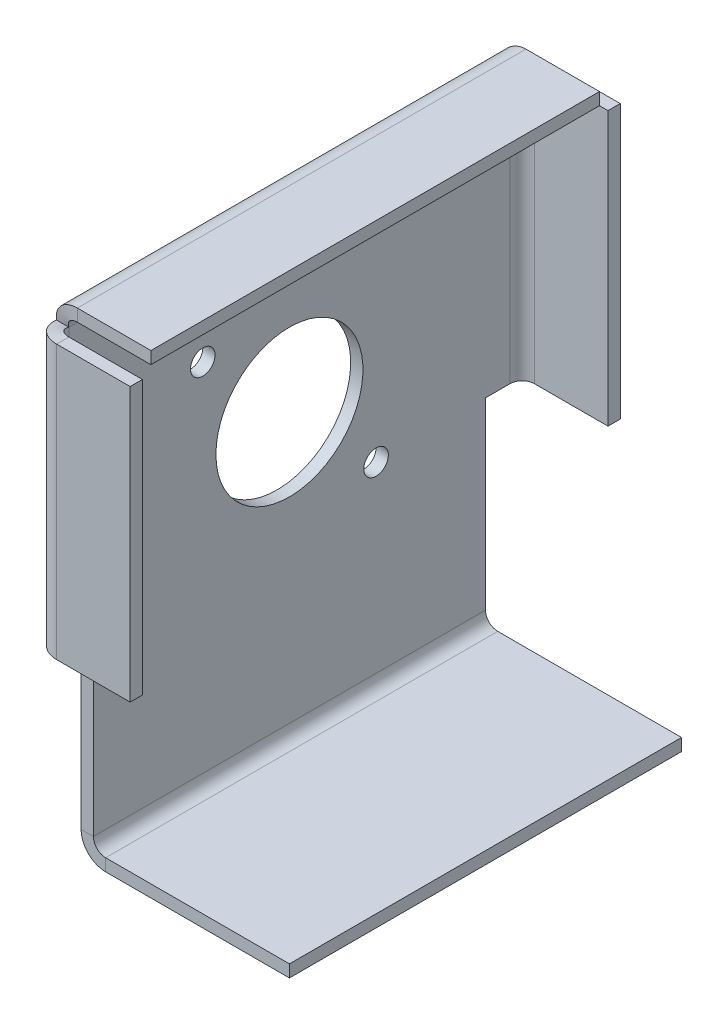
ISO-10303-21;
HEADER;
FILE_DESCRIPTION(('STEP AP214'),'2;1');
FILE_NAME('part.step','',(''),(''),'','','');
FILE_SCHEMA(('AUTOMOTIVE_DESIGN { 1 0 10303 214 1 1 1 1 }'));
ENDSEC;
DATA;
#1=APPLICATION_CONTEXT('core data for automotive mechanical design processes');
#2=APPLICATION_PROTOCOL_DEFINITION('international standard','automotive_design',2000,#1);
#3=PRODUCT_CONTEXT('',#1,'mechanical');
#4=PRODUCT('Part','Part','',(#3));
#5=PRODUCT_RELATED_PRODUCT_CATEGORY('part','',(#4));
#6=PRODUCT_DEFINITION_FORMATION('','',#4);
#7=PRODUCT_DEFINITION_CONTEXT('part definition',#1,'design');
#8=PRODUCT_DEFINITION('design','',#6,#7);
#9=PRODUCT_DEFINITION_SHAPE('','',#8);
#10=(LENGTH_UNIT() NAMED_UNIT(*) SI_UNIT(.MILLI.,.METRE.));
#11=(NAMED_UNIT(*) PLANE_ANGLE_UNIT() SI_UNIT($,.RADIAN.));
#12=(NAMED_UNIT(*) SI_UNIT($,.STERADIAN.) SOLID_ANGLE_UNIT());
#13=UNCERTAINTY_MEASURE_WITH_UNIT(LENGTH_MEASURE(1.E-05),#10,'distance_accuracy_value','');
#14=(GEOMETRIC_REPRESENTATION_CONTEXT(3) GLOBAL_UNCERTAINTY_ASSIGNED_CONTEXT((#13)) GLOBAL_UNIT_ASSIGNED_CONTEXT((#10,
#11,#12)) REPRESENTATION_CONTEXT('',''));
#15=CARTESIAN_POINT('',(0.,0.,0.));
#16=DIRECTION('',(0.,0.,1.));
#17=DIRECTION('',(1.,0.,0.));
#18=AXIS2_PLACEMENT_3D('',#15,#16,#17);
#19=CARTESIAN_POINT('',(0.,0.,25.4));
#20=DIRECTION('',(1.,0.,0.));
#21=DIRECTION('',(0.,0.,-1.));
#22=AXIS2_PLACEMENT_3D('',#19,#20,#21);
#23=PLANE('',#22);
#24=CARTESIAN_POINT('',(0.,25.2871798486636,-11.2253201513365));
#25=DIRECTION('',(-1.,0.,0.));
#26=DIRECTION('',(0.,0.,1.));
#27=AXIS2_PLACEMENT_3D('',#24,#25,#26);
#28=CIRCLE('',#27,1.5875);
#29=CARTESIAN_POINT('',(0.,25.2871798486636,-9.6378201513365));
#30=VERTEX_POINT('',#29);
#31=EDGE_CURVE('E851',#30,#30,#28,.T.);
#32=ORIENTED_EDGE('',*,*,#31,.T.);
#33=EDGE_LOOP('',(#32));
#34=FACE_BOUND('',#33,.T.);
#35=CARTESIAN_POINT('',(0.,47.7378201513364,11.2253201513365));
#36=DIRECTION('',(-1.,0.,0.));
#37=DIRECTION('',(0.,0.,1.));
#38=AXIS2_PLACEMENT_3D('',#35,#36,#37);
#39=CIRCLE('',#38,1.5875);
#40=CARTESIAN_POINT('',(0.,47.7378201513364,12.8128201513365));
#41=VERTEX_POINT('',#40);
#42=EDGE_CURVE('E861',#41,#41,#39,.T.);
#43=ORIENTED_EDGE('',*,*,#42,.T.);
#44=EDGE_LOOP('',(#43));
#45=FACE_BOUND('',#44,.T.);
#46=CARTESIAN_POINT('',(0.,36.5125,0.));
#47=DIRECTION('',(-1.,0.,0.));
#48=DIRECTION('',(0.,0.,1.));
#49=AXIS2_PLACEMENT_3D('',#46,#47,#48);
#50=CIRCLE('',#49,9.525);
#51=CARTESIAN_POINT('',(0.,36.5125,9.525));
#52=VERTEX_POINT('',#51);
#53=EDGE_CURVE('E227',#52,#52,#50,.T.);
#54=ORIENTED_EDGE('',*,*,#53,.T.);
#55=EDGE_LOOP('',(#54));
#56=FACE_BOUND('',#55,.T.);
#57=DIRECTION('',(0.,0.,-1.));
#58=VECTOR('',#57,1.);
#59=CARTESIAN_POINT('',(0.,25.4,-25.4));
#60=LINE('',#59,#58);
#61=CARTESIAN_POINT('',(0.,25.4,-25.4));
#62=VERTEX_POINT('',#61);
#63=CARTESIAN_POINT('',(0.,25.4,-28.5749999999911));
#64=VERTEX_POINT('',#63);
#65=EDGE_CURVE('E356',#62,#64,#60,.T.);
#66=ORIENTED_EDGE('',*,*,#65,.T.);
#67=DIRECTION('',(0.,-1.,0.));
#68=VECTOR('',#67,1.);
#69=CARTESIAN_POINT('',(0.,63.500000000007,-28.5749999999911));
#70=LINE('',#69,#68);
#71=CARTESIAN_POINT('',(0.,60.3249999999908,-28.5749999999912));
#72=VERTEX_POINT('',#71);
#73=EDGE_CURVE('E241',#72,#64,#70,.T.);
#74=ORIENTED_EDGE('',*,*,#73,.F.);
#75=DIRECTION('',(0.,0.,-1.));
#76=VECTOR('',#75,1.);
#77=CARTESIAN_POINT('',(0.,60.3249999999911,31.750000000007));
#78=LINE('',#77,#76);
#79=CARTESIAN_POINT('',(0.,60.3249999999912,28.5749999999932));
#80=VERTEX_POINT('',#79);
#81=EDGE_CURVE('E255',#80,#72,#78,.T.);
#82=ORIENTED_EDGE('',*,*,#81,.F.);
#83=DIRECTION('',(0.,1.,0.));
#84=VECTOR('',#83,1.);
#85=CARTESIAN_POINT('',(0.,-292.100000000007,28.5749999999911));
#86=LINE('',#85,#84);
#87=CARTESIAN_POINT('',(0.,25.4,28.5749999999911));
#88=VERTEX_POINT('',#87);
#89=EDGE_CURVE('E311',#88,#80,#86,.T.);
#90=ORIENTED_EDGE('',*,*,#89,.F.);
#91=DIRECTION('',(0.,0.,-1.));
#92=VECTOR('',#91,1.);
#93=CARTESIAN_POINT('',(0.,25.4,25.4));
#94=LINE('',#93,#92);
#95=CARTESIAN_POINT('',(0.,25.4,25.4));
#96=VERTEX_POINT('',#95);
#97=EDGE_CURVE('E364',#88,#96,#94,.T.);
#98=ORIENTED_EDGE('',*,*,#97,.T.);
#99=DIRECTION('',(0.,-1.,0.));
#100=VECTOR('',#99,1.);
#101=CARTESIAN_POINT('',(0.,0.,25.4));
#102=LINE('',#101,#100);
#103=CARTESIAN_POINT('',(0.,1.5875,25.4));
#104=VERTEX_POINT('',#103);
#105=EDGE_CURVE('E401',#96,#104,#102,.T.);
#106=ORIENTED_EDGE('',*,*,#105,.T.);
#107=DIRECTION('',(0.,0.,-1.));
#108=VECTOR('',#107,1.);
#109=CARTESIAN_POINT('',(0.,1.5875,25.4));
#110=LINE('',#109,#108);
#111=CARTESIAN_POINT('',(0.,1.5875,-25.4));
#112=VERTEX_POINT('',#111);
#113=EDGE_CURVE('E414',#104,#112,#110,.T.);
#114=ORIENTED_EDGE('',*,*,#113,.T.);
#115=DIRECTION('',(0.,-1.,0.));
#116=VECTOR('',#115,1.);
#117=CARTESIAN_POINT('',(0.,0.,-25.4));
#118=LINE('',#117,#116);
#119=EDGE_CURVE('E383',#62,#112,#118,.T.);
#120=ORIENTED_EDGE('',*,*,#119,.F.);
#121=EDGE_LOOP('',(#66,#74,#82,#90,#98,#106,#114,#120));
#122=FACE_BOUND('',#121,.T.);
#123=ADVANCED_FACE('F30',(#34,#45,#56,#122),#23,.T.);
#124=CARTESIAN_POINT('',(-1.5875,0.,25.4));
#125=DIRECTION('',(1.,0.,0.));
#126=DIRECTION('',(0.,0.,-1.));
#127=AXIS2_PLACEMENT_3D('',#124,#125,#126);
#128=PLANE('',#127);
#129=CARTESIAN_POINT('',(-1.5875,25.2871798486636,-11.2253201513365));
#130=DIRECTION('',(-1.,0.,0.));
#131=DIRECTION('',(0.,0.,1.));
#132=AXIS2_PLACEMENT_3D('',#129,#130,#131);
#133=CIRCLE('',#132,1.5875);
#134=CARTESIAN_POINT('',(-1.5875,25.2871798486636,-9.6378201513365));
#135=VERTEX_POINT('',#134);
#136=EDGE_CURVE('E854',#135,#135,#133,.T.);
#137=ORIENTED_EDGE('',*,*,#136,.F.);
#138=EDGE_LOOP('',(#137));
#139=FACE_BOUND('',#138,.T.);
#140=CARTESIAN_POINT('',(-1.5875,47.7378201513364,11.2253201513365));
#141=DIRECTION('',(-1.,0.,0.));
#142=DIRECTION('',(0.,0.,1.));
#143=AXIS2_PLACEMENT_3D('',#140,#141,#142);
#144=CIRCLE('',#143,1.5875);
#145=CARTESIAN_POINT('',(-1.5875,47.7378201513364,12.8128201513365));
#146=VERTEX_POINT('',#145);
#147=EDGE_CURVE('E856',#146,#146,#144,.T.);
#148=ORIENTED_EDGE('',*,*,#147,.F.);
#149=EDGE_LOOP('',(#148));
#150=FACE_BOUND('',#149,.T.);
#151=CARTESIAN_POINT('',(-1.5875,36.5125,0.));
#152=DIRECTION('',(-1.,0.,0.));
#153=DIRECTION('',(0.,0.,1.));
#154=AXIS2_PLACEMENT_3D('',#151,#152,#153);
#155=CIRCLE('',#154,9.525);
#156=CARTESIAN_POINT('',(-1.5875,36.5125,9.525));
#157=VERTEX_POINT('',#156);
#158=EDGE_CURVE('E864',#157,#157,#155,.T.);
#159=ORIENTED_EDGE('',*,*,#158,.F.);
#160=EDGE_LOOP('',(#159));
#161=FACE_BOUND('',#160,.T.);
#162=DIRECTION('',(0.,-1.,0.));
#163=VECTOR('',#162,1.);
#164=CARTESIAN_POINT('',(-1.5875,63.5000000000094,-28.5749999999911));
#165=LINE('',#164,#163);
#166=CARTESIAN_POINT('',(-1.5875,60.3249999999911,-28.5749999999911));
#167=VERTEX_POINT('',#166);
#168=CARTESIAN_POINT('',(-1.5875,25.4,-28.5749999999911));
#169=VERTEX_POINT('',#168);
#170=EDGE_CURVE('E237',#167,#169,#165,.T.);
#171=ORIENTED_EDGE('',*,*,#170,.T.);
#172=DIRECTION('',(0.,0.,-1.));
#173=VECTOR('',#172,1.);
#174=CARTESIAN_POINT('',(-1.5875,25.4,-25.4));
#175=LINE('',#174,#173);
#176=CARTESIAN_POINT('',(-1.5875,25.4,-25.4));
#177=VERTEX_POINT('',#176);
#178=EDGE_CURVE('E52',#177,#169,#175,.T.);
#179=ORIENTED_EDGE('',*,*,#178,.F.);
#180=DIRECTION('',(0.,1.,0.));
#181=VECTOR('',#180,1.);
#182=CARTESIAN_POINT('',(-1.5875,0.,-25.4));
#183=LINE('',#182,#181);
#184=CARTESIAN_POINT('',(-1.5875,1.5875,-25.4));
#185=VERTEX_POINT('',#184);
#186=EDGE_CURVE('E385',#177,#185,#183,.F.);
#187=ORIENTED_EDGE('',*,*,#186,.T.);
#188=DIRECTION('',(0.,0.,-1.));
#189=VECTOR('',#188,1.);
#190=CARTESIAN_POINT('',(-1.5875,1.5875,25.4));
#191=LINE('',#190,#189);
#192=CARTESIAN_POINT('',(-1.5875,1.5875,25.4));
#193=VERTEX_POINT('',#192);
#194=EDGE_CURVE('E411',#193,#185,#191,.T.);
#195=ORIENTED_EDGE('',*,*,#194,.F.);
#196=DIRECTION('',(0.,1.,0.));
#197=VECTOR('',#196,1.);
#198=CARTESIAN_POINT('',(-1.5875,0.,25.4));
#199=LINE('',#198,#197);
#200=CARTESIAN_POINT('',(-1.5875,25.4,25.4));
#201=VERTEX_POINT('',#200);
#202=EDGE_CURVE('E403',#201,#193,#199,.F.);
#203=ORIENTED_EDGE('',*,*,#202,.F.);
#204=DIRECTION('',(0.,0.,-1.));
#205=VECTOR('',#204,1.);
#206=CARTESIAN_POINT('',(-1.5875,25.4,25.4));
#207=LINE('',#206,#205);
#208=CARTESIAN_POINT('',(-1.5875,25.3999999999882,28.5749999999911));
#209=VERTEX_POINT('',#208);
#210=EDGE_CURVE('E366',#209,#201,#207,.T.);
#211=ORIENTED_EDGE('',*,*,#210,.F.);
#212=DIRECTION('',(0.,1.,0.));
#213=VECTOR('',#212,1.);
#214=CARTESIAN_POINT('',(-1.5875,-292.100000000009,28.5749999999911));
#215=LINE('',#214,#213);
#216=CARTESIAN_POINT('',(-1.5875,60.3249999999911,28.5749999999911));
#217=VERTEX_POINT('',#216);
#218=EDGE_CURVE('E283',#209,#217,#215,.T.);
#219=ORIENTED_EDGE('',*,*,#218,.T.);
#220=DIRECTION('',(0.,0.,-1.));
#221=VECTOR('',#220,1.);
#222=CARTESIAN_POINT('',(-1.5875,60.3249999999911,31.7500000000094));
#223=LINE('',#222,#221);
#224=EDGE_CURVE('E291',#217,#167,#223,.T.);
#225=ORIENTED_EDGE('',*,*,#224,.T.);
#226=EDGE_LOOP('',(#171,#179,#187,#195,#203,#211,#219,#225));
#227=FACE_BOUND('',#226,.T.);
#228=ADVANCED_FACE('F482',(#139,#150,#161,#227),#128,.F.);
#229=CARTESIAN_POINT('',(-1.5875,25.4,25.4));
#230=DIRECTION('',(0.,-1.,0.));
#231=DIRECTION('',(0.,0.,-1.));
#232=AXIS2_PLACEMENT_3D('',#229,#230,#231);
#233=PLANE('',#232);
#234=ORIENTED_EDGE('',*,*,#97,.F.);
#235=DIRECTION('',(1.,0.,0.));
#236=VECTOR('',#235,1.);
#237=CARTESIAN_POINT('',(-1.5875,25.3999999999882,28.5749999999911));
#238=LINE('',#237,#236);
#239=EDGE_CURVE('E321',#209,#88,#238,.T.);
#240=ORIENTED_EDGE('',*,*,#239,.F.);
#241=ORIENTED_EDGE('',*,*,#210,.T.);
#242=DIRECTION('',(1.,0.,0.));
#243=VECTOR('',#242,1.);
#244=CARTESIAN_POINT('',(-1.5875,25.4,25.4));
#245=LINE('',#244,#243);
#246=EDGE_CURVE('E368',#201,#96,#245,.T.);
#247=ORIENTED_EDGE('',*,*,#246,.T.);
#248=EDGE_LOOP('',(#234,#240,#241,#247));
#249=FACE_BOUND('',#248,.T.);
#250=ADVANCED_FACE('F489',(#249),#233,.T.);
#251=CARTESIAN_POINT('',(-1.5875,25.4,-25.4));
#252=DIRECTION('',(0.,-1.,0.));
#253=DIRECTION('',(0.,0.,-1.));
#254=AXIS2_PLACEMENT_3D('',#251,#252,#253);
#255=PLANE('',#254);
#256=ORIENTED_EDGE('',*,*,#178,.T.);
#257=DIRECTION('',(1.,0.,0.));
#258=VECTOR('',#257,1.);
#259=CARTESIAN_POINT('',(-1.5875,25.4,-28.5749999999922));
#260=LINE('',#259,#258);
#261=EDGE_CURVE('E45',#169,#64,#260,.T.);
#262=ORIENTED_EDGE('',*,*,#261,.T.);
#263=ORIENTED_EDGE('',*,*,#65,.F.);
#264=DIRECTION('',(1.,0.,0.));
#265=VECTOR('',#264,1.);
#266=CARTESIAN_POINT('',(-1.5875,25.4,-25.4));
#267=LINE('',#266,#265);
#268=EDGE_CURVE('E361',#177,#62,#267,.T.);
#269=ORIENTED_EDGE('',*,*,#268,.F.);
#270=EDGE_LOOP('',(#256,#262,#263,#269));
#271=FACE_BOUND('',#270,.T.);
#272=ADVANCED_FACE('F543',(#271),#255,.T.);
#273=CARTESIAN_POINT('',(1.5875,0.,25.4));
#274=DIRECTION('',(0.,0.,1.));
#275=DIRECTION('',(1.,0.,0.));
#276=AXIS2_PLACEMENT_3D('',#273,#274,#275);
#277=PLANE('',#276);
#278=DIRECTION('',(0.,-1.,0.));
#279=VECTOR('',#278,1.);
#280=CARTESIAN_POINT('',(1.5875,0.,25.4));
#281=LINE('',#280,#279);
#282=CARTESIAN_POINT('',(1.5875,0.,25.4));
#283=VERTEX_POINT('',#282);
#284=CARTESIAN_POINT('',(1.5875,-1.5875,25.4));
#285=VERTEX_POINT('',#284);
#286=EDGE_CURVE('E11',#283,#285,#281,.T.);
#287=ORIENTED_EDGE('',*,*,#286,.F.);
#288=CARTESIAN_POINT('',(1.5875,1.5875,25.4));
#289=DIRECTION('',(0.,0.,-1.));
#290=DIRECTION('',(-1.,0.,0.));
#291=AXIS2_PLACEMENT_3D('',#288,#289,#290);
#292=CIRCLE('',#291,1.5875);
#293=EDGE_CURVE('E398',#104,#283,#292,.F.);
#294=ORIENTED_EDGE('',*,*,#293,.F.);
#295=DIRECTION('',(1.,0.,0.));
#296=VECTOR('',#295,1.);
#297=CARTESIAN_POINT('',(-1.5875,1.5875,25.4));
#298=LINE('',#297,#296);
#299=EDGE_CURVE('E38',#193,#104,#298,.T.);
#300=ORIENTED_EDGE('',*,*,#299,.F.);
#301=CARTESIAN_POINT('',(1.5875,1.5875,25.4));
#302=DIRECTION('',(0.,0.,1.));
#303=DIRECTION('',(1.,0.,0.));
#304=AXIS2_PLACEMENT_3D('',#301,#302,#303);
#305=CIRCLE('',#304,3.175);
#306=EDGE_CURVE('E405',#193,#285,#305,.T.);
#307=ORIENTED_EDGE('',*,*,#306,.T.);
#308=EDGE_LOOP('',(#287,#294,#300,#307));
#309=FACE_BOUND('',#308,.T.);
#310=ADVANCED_FACE('F32',(#309),#277,.T.);
#311=CARTESIAN_POINT('',(-1.5875,1.5875,25.4));
#312=DIRECTION('',(0.,0.,1.));
#313=DIRECTION('',(1.,0.,0.));
#314=AXIS2_PLACEMENT_3D('',#311,#312,#313);
#315=PLANE('',#314);
#316=DIRECTION('',(1.,0.,0.));
#317=VECTOR('',#316,1.);
#318=CARTESIAN_POINT('',(0.,0.,25.4));
#319=LINE('',#318,#317);
#320=CARTESIAN_POINT('',(25.4,0.,25.4));
#321=VERTEX_POINT('',#320);
#322=EDGE_CURVE('E395',#283,#321,#319,.T.);
#323=ORIENTED_EDGE('',*,*,#322,.F.);
#324=ORIENTED_EDGE('',*,*,#286,.T.);
#325=DIRECTION('',(1.,0.,0.));
#326=VECTOR('',#325,1.);
#327=CARTESIAN_POINT('',(0.,-1.5875,25.4));
#328=LINE('',#327,#326);
#329=CARTESIAN_POINT('',(25.4,-1.5875,25.4));
#330=VERTEX_POINT('',#329);
#331=EDGE_CURVE('E390',#285,#330,#328,.T.);
#332=ORIENTED_EDGE('',*,*,#331,.T.);
#333=DIRECTION('',(0.,-1.,0.));
#334=VECTOR('',#333,1.);
#335=CARTESIAN_POINT('',(25.4,0.,25.4));
#336=LINE('',#335,#334);
#337=EDGE_CURVE('E392',#321,#330,#336,.T.);
#338=ORIENTED_EDGE('',*,*,#337,.F.);
#339=EDGE_LOOP('',(#323,#324,#332,#338));
#340=FACE_BOUND('',#339,.T.);
#341=ADVANCED_FACE('F453',(#340),#315,.T.);
#342=CARTESIAN_POINT('',(0.,1.5875,-25.4));
#343=DIRECTION('',(0.,0.,-1.));
#344=DIRECTION('',(-1.,0.,0.));
#345=AXIS2_PLACEMENT_3D('',#342,#343,#344);
#346=PLANE('',#345);
#347=DIRECTION('',(-1.,0.,0.));
#348=VECTOR('',#347,1.);
#349=CARTESIAN_POINT('',(0.,1.5875,-25.4));
#350=LINE('',#349,#348);
#351=EDGE_CURVE('E426',#112,#185,#350,.T.);
#352=ORIENTED_EDGE('',*,*,#351,.F.);
#353=CARTESIAN_POINT('',(1.5875,1.5875,-25.4));
#354=DIRECTION('',(0.,0.,-1.));
#355=DIRECTION('',(-1.,0.,0.));
#356=AXIS2_PLACEMENT_3D('',#353,#354,#355);
#357=CIRCLE('',#356,1.5875);
#358=CARTESIAN_POINT('',(1.5875,0.,-25.4));
#359=VERTEX_POINT('',#358);
#360=EDGE_CURVE('E380',#112,#359,#357,.F.);
#361=ORIENTED_EDGE('',*,*,#360,.T.);
#362=DIRECTION('',(0.,1.,0.));
#363=VECTOR('',#362,1.);
#364=CARTESIAN_POINT('',(1.5875,-1.5875,-25.4));
#365=LINE('',#364,#363);
#366=CARTESIAN_POINT('',(1.5875,-1.5875,-25.4));
#367=VERTEX_POINT('',#366);
#368=EDGE_CURVE('E424',#367,#359,#365,.T.);
#369=ORIENTED_EDGE('',*,*,#368,.F.);
#370=CARTESIAN_POINT('',(1.5875,1.5875,-25.4));
#371=DIRECTION('',(0.,0.,1.));
#372=DIRECTION('',(1.,0.,0.));
#373=AXIS2_PLACEMENT_3D('',#370,#371,#372);
#374=CIRCLE('',#373,3.175);
#375=EDGE_CURVE('E387',#185,#367,#374,.T.);
#376=ORIENTED_EDGE('',*,*,#375,.F.);
#377=EDGE_LOOP('',(#352,#361,#369,#376));
#378=FACE_BOUND('',#377,.T.);
#379=ADVANCED_FACE('F465',(#378),#346,.T.);
#380=CARTESIAN_POINT('',(1.5875,-1.5875,-25.4));
#381=DIRECTION('',(0.,0.,-1.));
#382=DIRECTION('',(-1.,0.,0.));
#383=AXIS2_PLACEMENT_3D('',#380,#381,#382);
#384=PLANE('',#383);
#385=ORIENTED_EDGE('',*,*,#268,.T.);
#386=ORIENTED_EDGE('',*,*,#119,.T.);
#387=ORIENTED_EDGE('',*,*,#351,.T.);
#388=ORIENTED_EDGE('',*,*,#186,.F.);
#389=EDGE_LOOP('',(#385,#386,#387,#388));
#390=FACE_BOUND('',#389,.T.);
#391=ADVANCED_FACE('F471',(#390),#384,.T.);
#392=CARTESIAN_POINT('',(0.,-1.5875,25.4));
#393=DIRECTION('',(0.,1.,0.));
#394=DIRECTION('',(0.,0.,1.));
#395=AXIS2_PLACEMENT_3D('',#392,#393,#394);
#396=PLANE('',#395);
#397=DIRECTION('',(1.,0.,0.));
#398=VECTOR('',#397,1.);
#399=CARTESIAN_POINT('',(0.,-1.5875,-25.4));
#400=LINE('',#399,#398);
#401=CARTESIAN_POINT('',(25.4,-1.5875,-25.4));
#402=VERTEX_POINT('',#401);
#403=EDGE_CURVE('E371',#367,#402,#400,.T.);
#404=ORIENTED_EDGE('',*,*,#403,.T.);
#405=DIRECTION('',(0.,0.,-1.));
#406=VECTOR('',#405,1.);
#407=CARTESIAN_POINT('',(25.4,-1.5875,25.4));
#408=LINE('',#407,#406);
#409=EDGE_CURVE('E422',#330,#402,#408,.T.);
#410=ORIENTED_EDGE('',*,*,#409,.F.);
#411=ORIENTED_EDGE('',*,*,#331,.F.);
#412=DIRECTION('',(0.,0.,-1.));
#413=VECTOR('',#412,1.);
#414=CARTESIAN_POINT('',(1.5875,-1.5875,25.4));
#415=LINE('',#414,#413);
#416=EDGE_CURVE('E408',#285,#367,#415,.T.);
#417=ORIENTED_EDGE('',*,*,#416,.T.);
#418=EDGE_LOOP('',(#404,#410,#411,#417));
#419=FACE_BOUND('',#418,.T.);
#420=ADVANCED_FACE('F469',(#419),#396,.F.);
#421=CARTESIAN_POINT('',(25.4,0.,25.4));
#422=DIRECTION('',(1.,0.,0.));
#423=DIRECTION('',(0.,0.,-1.));
#424=AXIS2_PLACEMENT_3D('',#421,#422,#423);
#425=PLANE('',#424);
#426=DIRECTION('',(0.,-1.,0.));
#427=VECTOR('',#426,1.);
#428=CARTESIAN_POINT('',(25.4,0.,-25.4));
#429=LINE('',#428,#427);
#430=CARTESIAN_POINT('',(25.4,0.,-25.4));
#431=VERTEX_POINT('',#430);
#432=EDGE_CURVE('E374',#431,#402,#429,.T.);
#433=ORIENTED_EDGE('',*,*,#432,.F.);
#434=DIRECTION('',(0.,0.,-1.));
#435=VECTOR('',#434,1.);
#436=CARTESIAN_POINT('',(25.4,0.,25.4));
#437=LINE('',#436,#435);
#438=EDGE_CURVE('E420',#321,#431,#437,.T.);
#439=ORIENTED_EDGE('',*,*,#438,.F.);
#440=ORIENTED_EDGE('',*,*,#337,.T.);
#441=ORIENTED_EDGE('',*,*,#409,.T.);
#442=EDGE_LOOP('',(#433,#439,#440,#441));
#443=FACE_BOUND('',#442,.T.);
#444=ADVANCED_FACE('F458',(#443),#425,.T.);
#445=CARTESIAN_POINT('',(0.,0.,25.4));
#446=DIRECTION('',(0.,1.,0.));
#447=DIRECTION('',(0.,0.,1.));
#448=AXIS2_PLACEMENT_3D('',#445,#446,#447);
#449=PLANE('',#448);
#450=DIRECTION('',(1.,0.,0.));
#451=VECTOR('',#450,1.);
#452=CARTESIAN_POINT('',(0.,0.,-25.4));
#453=LINE('',#452,#451);
#454=EDGE_CURVE('E377',#359,#431,#453,.T.);
#455=ORIENTED_EDGE('',*,*,#454,.F.);
#456=DIRECTION('',(0.,0.,-1.));
#457=VECTOR('',#456,1.);
#458=CARTESIAN_POINT('',(1.5875,0.,25.4));
#459=LINE('',#458,#457);
#460=EDGE_CURVE('E417',#283,#359,#459,.T.);
#461=ORIENTED_EDGE('',*,*,#460,.F.);
#462=ORIENTED_EDGE('',*,*,#322,.T.);
#463=ORIENTED_EDGE('',*,*,#438,.T.);
#464=EDGE_LOOP('',(#455,#461,#462,#463));
#465=FACE_BOUND('',#464,.T.);
#466=ADVANCED_FACE('F451',(#465),#449,.T.);
#467=CARTESIAN_POINT('',(1.5875,1.5875,25.4));
#468=DIRECTION('',(0.,0.,-1.));
#469=DIRECTION('',(-1.,0.,0.));
#470=AXIS2_PLACEMENT_3D('',#467,#468,#469);
#471=CYLINDRICAL_SURFACE('',#470,1.5875);
#472=ORIENTED_EDGE('',*,*,#360,.F.);
#473=ORIENTED_EDGE('',*,*,#113,.F.);
#474=ORIENTED_EDGE('',*,*,#293,.T.);
#475=ORIENTED_EDGE('',*,*,#460,.T.);
#476=EDGE_LOOP('',(#472,#473,#474,#475));
#477=FACE_BOUND('',#476,.T.);
#478=ADVANCED_FACE('F441',(#477),#471,.F.);
#479=CARTESIAN_POINT('',(1.5875,1.5875,25.4));
#480=DIRECTION('',(0.,0.,-1.));
#481=DIRECTION('',(-1.,0.,0.));
#482=AXIS2_PLACEMENT_3D('',#479,#480,#481);
#483=CYLINDRICAL_SURFACE('',#482,3.175);
#484=ORIENTED_EDGE('',*,*,#375,.T.);
#485=ORIENTED_EDGE('',*,*,#416,.F.);
#486=ORIENTED_EDGE('',*,*,#306,.F.);
#487=ORIENTED_EDGE('',*,*,#194,.T.);
#488=EDGE_LOOP('',(#484,#485,#486,#487));
#489=FACE_BOUND('',#488,.T.);
#490=ADVANCED_FACE('F467',(#489),#483,.T.);
#491=CARTESIAN_POINT('',(1.5875,1.5875,25.4));
#492=DIRECTION('',(0.,0.,-1.));
#493=DIRECTION('',(-1.,0.,0.));
#494=AXIS2_PLACEMENT_3D('',#491,#492,#493);
#495=PLANE('',#494);
#496=ORIENTED_EDGE('',*,*,#105,.F.);
#497=ORIENTED_EDGE('',*,*,#246,.F.);
#498=ORIENTED_EDGE('',*,*,#202,.T.);
#499=ORIENTED_EDGE('',*,*,#299,.T.);
#500=EDGE_LOOP('',(#496,#497,#498,#499));
#501=FACE_BOUND('',#500,.T.);
#502=ADVANCED_FACE('F433',(#501),#495,.F.);
#503=CARTESIAN_POINT('',(1.5875,1.5875,-25.4));
#504=DIRECTION('',(0.,0.,-1.));
#505=DIRECTION('',(-1.,0.,0.));
#506=AXIS2_PLACEMENT_3D('',#503,#504,#505);
#507=PLANE('',#506);
#508=ORIENTED_EDGE('',*,*,#403,.F.);
#509=ORIENTED_EDGE('',*,*,#368,.T.);
#510=ORIENTED_EDGE('',*,*,#454,.T.);
#511=ORIENTED_EDGE('',*,*,#432,.T.);
#512=EDGE_LOOP('',(#508,#509,#510,#511));
#513=FACE_BOUND('',#512,.T.);
#514=ADVANCED_FACE('F461',(#513),#507,.T.);
#515=CARTESIAN_POINT('',(11.1125,25.4,31.75));
#516=DIRECTION('',(-1.,0.,-9.30467426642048E-13));
#517=DIRECTION('',(0.,1.,0.));
#518=AXIS2_PLACEMENT_3D('',#515,#516,#517);
#519=PLANE('',#518);
#520=DIRECTION('',(9.30467426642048E-13,0.,-1.));
#521=VECTOR('',#520,1.);
#522=CARTESIAN_POINT('',(11.1125,60.8059231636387,31.75));
#523=LINE('',#522,#521);
#524=CARTESIAN_POINT('',(11.1125,60.8059231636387,31.75));
#525=VERTEX_POINT('',#524);
#526=CARTESIAN_POINT('',(11.1125000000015,60.8059231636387,30.1625));
#527=VERTEX_POINT('',#526);
#528=EDGE_CURVE('E354',#525,#527,#523,.T.);
#529=ORIENTED_EDGE('',*,*,#528,.F.);
#530=DIRECTION('',(0.,1.,0.));
#531=VECTOR('',#530,1.);
#532=CARTESIAN_POINT('',(11.1125,25.4,31.75));
#533=LINE('',#532,#531);
#534=CARTESIAN_POINT('',(11.1125,25.4,31.75));
#535=VERTEX_POINT('',#534);
#536=EDGE_CURVE('E324',#535,#525,#533,.T.);
#537=ORIENTED_EDGE('',*,*,#536,.F.);
#538=DIRECTION('',(9.30467426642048E-13,0.,-1.));
#539=VECTOR('',#538,1.);
#540=CARTESIAN_POINT('',(11.1125,25.4,31.75));
#541=LINE('',#540,#539);
#542=CARTESIAN_POINT('',(11.1125000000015,25.4,30.1625));
#543=VERTEX_POINT('',#542);
#544=EDGE_CURVE('E352',#535,#543,#541,.T.);
#545=ORIENTED_EDGE('',*,*,#544,.T.);
#546=DIRECTION('',(0.,1.,0.));
#547=VECTOR('',#546,1.);
#548=CARTESIAN_POINT('',(11.1125000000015,25.4,30.1625));
#549=LINE('',#548,#547);
#550=EDGE_CURVE('E338',#543,#527,#549,.T.);
#551=ORIENTED_EDGE('',*,*,#550,.T.);
#552=EDGE_LOOP('',(#529,#537,#545,#551));
#553=FACE_BOUND('',#552,.T.);
#554=ADVANCED_FACE('F522',(#553),#519,.F.);
#555=CARTESIAN_POINT('',(11.1125,25.4,31.75));
#556=DIRECTION('',(7.44701763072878E-13,-1.,0.));
#557=DIRECTION('',(-1.,-7.44701763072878E-13,-9.30467426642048E-13));
#558=AXIS2_PLACEMENT_3D('',#555,#556,#557);
#559=PLANE('',#558);
#560=ORIENTED_EDGE('',*,*,#544,.F.);
#561=DIRECTION('',(-1.,-7.44701763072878E-13,-9.30467426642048E-13));
#562=VECTOR('',#561,1.);
#563=CARTESIAN_POINT('',(11.1125,25.4,31.75));
#564=LINE('',#563,#562);
#565=CARTESIAN_POINT('',(1.58749999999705,25.3999999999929,31.7499999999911));
#566=VERTEX_POINT('',#565);
#567=EDGE_CURVE('E327',#535,#566,#564,.T.);
#568=ORIENTED_EDGE('',*,*,#567,.T.);
#569=DIRECTION('',(9.30467426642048E-13,0.,-1.));
#570=VECTOR('',#569,1.);
#571=CARTESIAN_POINT('',(1.58749999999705,25.3999999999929,31.7499999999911));
#572=LINE('',#571,#570);
#573=CARTESIAN_POINT('',(1.58749999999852,25.3999999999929,30.1624999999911));
#574=VERTEX_POINT('',#573);
#575=EDGE_CURVE('E350',#566,#574,#572,.T.);
#576=ORIENTED_EDGE('',*,*,#575,.T.);
#577=DIRECTION('',(-1.,0.,-9.30467426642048E-13));
#578=VECTOR('',#577,1.);
#579=CARTESIAN_POINT('',(11.1125000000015,25.4,30.1625));
#580=LINE('',#579,#578);
#581=EDGE_CURVE('E342',#543,#574,#580,.T.);
#582=ORIENTED_EDGE('',*,*,#581,.F.);
#583=EDGE_LOOP('',(#560,#568,#576,#582));
#584=FACE_BOUND('',#583,.T.);
#585=ADVANCED_FACE('F558',(#584),#559,.T.);
#586=CARTESIAN_POINT('',(11.1124999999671,60.8059231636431,31.75));
#587=DIRECTION('',(-9.30467426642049E-13,1.,0.));
#588=DIRECTION('',(1.,9.30467426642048E-13,9.30467426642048E-13));
#589=AXIS2_PLACEMENT_3D('',#586,#587,#588);
#590=PLANE('',#589);
#591=DIRECTION('',(1.,9.30467426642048E-13,9.30467426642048E-13));
#592=VECTOR('',#591,1.);
#593=CARTESIAN_POINT('',(11.1124999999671,60.8059231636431,31.75));
#594=LINE('',#593,#592);
#595=CARTESIAN_POINT('',(1.58749999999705,60.8059231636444,31.7499999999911));
#596=VERTEX_POINT('',#595);
#597=EDGE_CURVE('E335',#596,#525,#594,.T.);
#598=ORIENTED_EDGE('',*,*,#597,.T.);
#599=ORIENTED_EDGE('',*,*,#528,.T.);
#600=DIRECTION('',(-1.,0.,-9.30467426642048E-13));
#601=VECTOR('',#600,1.);
#602=CARTESIAN_POINT('',(11.1125000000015,60.8059231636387,30.1625));
#603=LINE('',#602,#601);
#604=CARTESIAN_POINT('',(1.58749999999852,60.8059231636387,30.1624999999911));
#605=VERTEX_POINT('',#604);
#606=EDGE_CURVE('E341',#605,#527,#603,.F.);
#607=ORIENTED_EDGE('',*,*,#606,.F.);
#608=DIRECTION('',(9.30467426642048E-13,0.,-1.));
#609=VECTOR('',#608,1.);
#610=CARTESIAN_POINT('',(1.58749999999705,60.8059231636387,31.7499999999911));
#611=LINE('',#610,#609);
#612=EDGE_CURVE('E349',#596,#605,#611,.T.);
#613=ORIENTED_EDGE('',*,*,#612,.F.);
#614=EDGE_LOOP('',(#598,#599,#607,#613));
#615=FACE_BOUND('',#614,.T.);
#616=ADVANCED_FACE('F568',(#615),#590,.T.);
#617=CARTESIAN_POINT('',(11.1125000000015,25.4,30.1625));
#618=DIRECTION('',(9.30467426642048E-13,0.,-1.));
#619=DIRECTION('',(-1.,0.,-9.30467426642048E-13));
#620=AXIS2_PLACEMENT_3D('',#617,#618,#619);
#621=PLANE('',#620);
#622=DIRECTION('',(0.,1.,0.));
#623=VECTOR('',#622,1.);
#624=CARTESIAN_POINT('',(1.58749999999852,25.4,30.1624999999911));
#625=LINE('',#624,#623);
#626=EDGE_CURVE('E339',#574,#605,#625,.T.);
#627=ORIENTED_EDGE('',*,*,#626,.T.);
#628=ORIENTED_EDGE('',*,*,#606,.T.);
#629=ORIENTED_EDGE('',*,*,#550,.F.);
#630=ORIENTED_EDGE('',*,*,#581,.T.);
#631=EDGE_LOOP('',(#627,#628,#629,#630));
#632=FACE_BOUND('',#631,.T.);
#633=ADVANCED_FACE('F571',(#632),#621,.T.);
#634=CARTESIAN_POINT('',(11.1125,25.4,31.75));
#635=DIRECTION('',(9.30467426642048E-13,0.,-1.));
#636=DIRECTION('',(-1.,0.,-9.30467426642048E-13));
#637=AXIS2_PLACEMENT_3D('',#634,#635,#636);
#638=PLANE('',#637);
#639=DIRECTION('',(0.,1.,0.));
#640=VECTOR('',#639,1.);
#641=CARTESIAN_POINT('',(1.58749999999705,25.3999999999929,31.7499999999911));
#642=LINE('',#641,#640);
#643=EDGE_CURVE('E330',#566,#596,#642,.T.);
#644=ORIENTED_EDGE('',*,*,#643,.F.);
#645=ORIENTED_EDGE('',*,*,#567,.F.);
#646=ORIENTED_EDGE('',*,*,#536,.T.);
#647=ORIENTED_EDGE('',*,*,#597,.F.);
#648=EDGE_LOOP('',(#644,#645,#646,#647));
#649=FACE_BOUND('',#648,.T.);
#650=ADVANCED_FACE('F580',(#649),#638,.F.);
#651=CARTESIAN_POINT('',(1.5875,25.3999999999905,28.5749999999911));
#652=DIRECTION('',(0.,1.,-7.45237205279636E-13));
#653=DIRECTION('',(0.,7.45237205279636E-13,1.));
#654=AXIS2_PLACEMENT_3D('',#651,#652,#653);
#655=PLANE('',#654);
#656=ORIENTED_EDGE('',*,*,#575,.F.);
#657=CARTESIAN_POINT('',(1.5875,25.3999999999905,28.5749999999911));
#658=DIRECTION('',(0.,-1.,7.45237205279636E-13));
#659=DIRECTION('',(0.,-7.45237205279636E-13,-1.));
#660=AXIS2_PLACEMENT_3D('',#657,#658,#659);
#661=CIRCLE('',#660,3.175);
#662=EDGE_CURVE('E305',#566,#209,#661,.T.);
#663=ORIENTED_EDGE('',*,*,#662,.T.);
#664=ORIENTED_EDGE('',*,*,#239,.T.);
#665=CARTESIAN_POINT('',(1.5875,25.3999999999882,28.5749999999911));
#666=DIRECTION('',(0.,1.,0.));
#667=DIRECTION('',(0.,0.,1.));
#668=AXIS2_PLACEMENT_3D('',#665,#666,#667);
#669=CIRCLE('',#668,1.5875);
#670=EDGE_CURVE('E314',#574,#88,#669,.F.);
#671=ORIENTED_EDGE('',*,*,#670,.F.);
#672=EDGE_LOOP('',(#656,#663,#664,#671));
#673=FACE_BOUND('',#672,.T.);
#674=ADVANCED_FACE('F595',(#673),#655,.F.);
#675=CARTESIAN_POINT('',(1.5875,60.8059231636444,30.1624999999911));
#676=CARTESIAN_POINT('',(1.5875,60.8059231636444,30.6916666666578));
#677=CARTESIAN_POINT('',(1.5875,60.8059231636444,31.2208333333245));
#678=CARTESIAN_POINT('',(1.5875,60.8059231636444,31.7499999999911));
#679=CARTESIAN_POINT('',(4.7625,60.8059231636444,30.1624999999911));
#680=CARTESIAN_POINT('',(5.82083333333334,60.8059231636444,30.6916666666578));
#681=CARTESIAN_POINT('',(6.87916666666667,60.8059231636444,31.2208333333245));
#682=CARTESIAN_POINT('',(7.9375,60.8059231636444,31.7499999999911));
#683=CARTESIAN_POINT('',(4.7625,59.8440768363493,26.9874999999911));
#684=CARTESIAN_POINT('',(5.82083333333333,59.8440768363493,26.4583333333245));
#685=CARTESIAN_POINT('',(6.87916666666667,59.8440768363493,25.9291666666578));
#686=CARTESIAN_POINT('',(7.9375,59.8440768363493,25.3999999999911));
#687=CARTESIAN_POINT('',(1.5875,59.8440768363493,26.9874999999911));
#688=CARTESIAN_POINT('',(1.5875,59.8440768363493,26.4583333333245));
#689=CARTESIAN_POINT('',(1.5875,59.8440768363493,25.9291666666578));
#690=CARTESIAN_POINT('',(1.5875,59.8440768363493,25.3999999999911));
#691=CARTESIAN_POINT('',(-1.5875,59.8440768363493,26.9874999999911));
#692=CARTESIAN_POINT('',(-2.64583333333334,59.8440768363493,26.4583333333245));
#693=CARTESIAN_POINT('',(-3.70416666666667,59.8440768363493,25.9291666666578));
#694=CARTESIAN_POINT('',(-4.7625,59.8440768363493,25.3999999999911));
#695=CARTESIAN_POINT('',(-1.5875,60.8059231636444,30.1624999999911));
#696=CARTESIAN_POINT('',(-2.64583333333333,60.8059231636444,30.6916666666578));
#697=CARTESIAN_POINT('',(-3.70416666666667,60.8059231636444,31.2208333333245));
#698=CARTESIAN_POINT('',(-4.7625,60.8059231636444,31.7499999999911));
#699=CARTESIAN_POINT('',(1.5875,60.8059231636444,30.1624999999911));
#700=CARTESIAN_POINT('',(1.5875,60.8059231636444,30.6916666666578));
#701=CARTESIAN_POINT('',(1.5875,60.8059231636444,31.2208333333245));
#702=CARTESIAN_POINT('',(1.5875,60.8059231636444,31.7499999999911));
#703=(BOUNDED_SURFACE() B_SPLINE_SURFACE(3,3,((#675,#676,#677,#678),(#679,#680,#681,#682),(#683,
#684,#685,#686),(#687,#688,#689,#690),(#691,#692,#693,#694),(#695,#696,#697,#698),(#699,#700,
#701,#702)),.UNSPECIFIED.,.T.,.F.,.F.) B_SPLINE_SURFACE_WITH_KNOTS((4,3,4),(4,4),(0.,0.5,1.),
(0.,1.),.UNSPECIFIED.) GEOMETRIC_REPRESENTATION_ITEM() RATIONAL_B_SPLINE_SURFACE(((1.,1.,1.,1.),
(0.333333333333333,0.333333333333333,0.333333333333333,0.333333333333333),(0.333333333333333,
0.333333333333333,0.333333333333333,0.333333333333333),(1.,1.,1.,1.),(0.333333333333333,
0.333333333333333,0.333333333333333,0.333333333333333),(0.333333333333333,0.333333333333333,
0.333333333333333,0.333333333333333),(1.,1.,1.,1.))) REPRESENTATION_ITEM('') SURFACE());
#704=CARTESIAN_POINT('',(1.5875,60.3249999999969,28.5749999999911));
#705=DIRECTION('',(0.,0.988721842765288,-0.149763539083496));
#706=DIRECTION('',(0.,0.149763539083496,0.988721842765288));
#707=AXIS2_PLACEMENT_3D('',#704,#705,#706);
#708=ELLIPSE('',#707,3.21121660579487,3.175);
#709=EDGE_CURVE('E308',#217,#596,#708,.T.);
#710=CARTESIAN_POINT('',(1.5875,60.3249999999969,28.5749999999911));
#711=DIRECTION('',(0.,0.957047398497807,-0.289931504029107));
#712=DIRECTION('',(0.,0.289931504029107,0.957047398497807));
#713=AXIS2_PLACEMENT_3D('',#710,#711,#712);
#714=ELLIPSE('',#713,1.65874752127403,1.5875);
#715=EDGE_CURVE('E317',#80,#605,#714,.T.);
#716=DIRECTION('',(1.,0.,0.));
#717=VECTOR('',#716,1.);
#718=CARTESIAN_POINT('',(-1.5875,60.3249999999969,28.5749999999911));
#719=LINE('',#718,#717);
#720=EDGE_CURVE('E320',#217,#80,#719,.T.);
#721=ORIENTED_EDGE('',*,*,#709,.T.);
#722=ORIENTED_EDGE('',*,*,#612,.T.);
#723=ORIENTED_EDGE('',*,*,#715,.F.);
#724=ORIENTED_EDGE('',*,*,#720,.F.);
#725=EDGE_LOOP('',(#721,#722,#723,#724));
#726=FACE_BOUND('',#725,.T.);
#727=ADVANCED_FACE('F604',(#726),#703,.F.);
#728=CARTESIAN_POINT('',(1.5875,-292.100000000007,28.5749999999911));
#729=DIRECTION('',(0.,1.,0.));
#730=DIRECTION('',(0.,0.,1.));
#731=AXIS2_PLACEMENT_3D('',#728,#729,#730);
#732=CYLINDRICAL_SURFACE('',#731,1.5875);
#733=ORIENTED_EDGE('',*,*,#89,.T.);
#734=ORIENTED_EDGE('',*,*,#715,.T.);
#735=ORIENTED_EDGE('',*,*,#626,.F.);
#736=ORIENTED_EDGE('',*,*,#670,.T.);
#737=EDGE_LOOP('',(#733,#734,#735,#736));
#738=FACE_BOUND('',#737,.T.);
#739=ADVANCED_FACE('F607',(#738),#732,.F.);
#740=CARTESIAN_POINT('',(1.5875,-292.100000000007,28.5749999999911));
#741=DIRECTION('',(0.,1.,0.));
#742=DIRECTION('',(0.,0.,1.));
#743=AXIS2_PLACEMENT_3D('',#740,#741,#742);
#744=CYLINDRICAL_SURFACE('',#743,3.175);
#745=ORIENTED_EDGE('',*,*,#218,.F.);
#746=ORIENTED_EDGE('',*,*,#662,.F.);
#747=ORIENTED_EDGE('',*,*,#643,.T.);
#748=ORIENTED_EDGE('',*,*,#709,.F.);
#749=EDGE_LOOP('',(#745,#746,#747,#748));
#750=FACE_BOUND('',#749,.T.);
#751=ADVANCED_FACE('F616',(#750),#744,.T.);
#752=CARTESIAN_POINT('',(11.1125,63.5,349.25));
#753=DIRECTION('',(-1.,-9.30467426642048E-13,0.));
#754=DIRECTION('',(0.,0.,-1.));
#755=AXIS2_PLACEMENT_3D('',#752,#753,#754);
#756=PLANE('',#755);
#757=DIRECTION('',(9.30467426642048E-13,-1.,0.));
#758=VECTOR('',#757,1.);
#759=CARTESIAN_POINT('',(11.1125,63.5000000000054,-29.0559231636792));
#760=LINE('',#759,#758);
#761=CARTESIAN_POINT('',(11.1125,63.5000000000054,-29.0559231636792));
#762=VERTEX_POINT('',#761);
#763=CARTESIAN_POINT('',(11.1125000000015,61.9125000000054,-29.0559231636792));
#764=VERTEX_POINT('',#763);
#765=EDGE_CURVE('E257',#762,#764,#760,.T.);
#766=ORIENTED_EDGE('',*,*,#765,.F.);
#767=DIRECTION('',(0.,0.,-1.));
#768=VECTOR('',#767,1.);
#769=CARTESIAN_POINT('',(11.1125,63.5,349.25));
#770=LINE('',#769,#768);
#771=CARTESIAN_POINT('',(11.1125,63.5000000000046,29.0559231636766));
#772=VERTEX_POINT('',#771);
#773=EDGE_CURVE('E274',#772,#762,#770,.T.);
#774=ORIENTED_EDGE('',*,*,#773,.F.);
#775=DIRECTION('',(9.30467426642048E-13,-1.,0.));
#776=VECTOR('',#775,1.);
#777=CARTESIAN_POINT('',(11.1125,63.5000000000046,29.0559231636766));
#778=LINE('',#777,#776);
#779=CARTESIAN_POINT('',(11.1125000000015,61.9125000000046,29.0559231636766));
#780=VERTEX_POINT('',#779);
#781=EDGE_CURVE('E231',#772,#780,#778,.T.);
#782=ORIENTED_EDGE('',*,*,#781,.T.);
#783=DIRECTION('',(0.,0.,-1.));
#784=VECTOR('',#783,1.);
#785=CARTESIAN_POINT('',(11.1125000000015,61.9125,349.25));
#786=LINE('',#785,#784);
#787=EDGE_CURVE('E262',#780,#764,#786,.T.);
#788=ORIENTED_EDGE('',*,*,#787,.T.);
#789=EDGE_LOOP('',(#766,#774,#782,#788));
#790=FACE_BOUND('',#789,.T.);
#791=ADVANCED_FACE('F631',(#790),#756,.F.);
#792=CARTESIAN_POINT('',(11.1125000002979,63.5000000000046,29.055923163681));
#793=DIRECTION('',(-9.30467426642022E-13,0.,1.));
#794=DIRECTION('',(-1.,-9.30467426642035E-13,-9.30467426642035E-13));
#795=AXIS2_PLACEMENT_3D('',#792,#793,#794);
#796=PLANE('',#795);
#797=ORIENTED_EDGE('',*,*,#781,.F.);
#798=DIRECTION('',(-1.,-9.30467426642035E-13,-9.30467426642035E-13));
#799=VECTOR('',#798,1.);
#800=CARTESIAN_POINT('',(11.1125000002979,63.5000000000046,29.055923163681));
#801=LINE('',#800,#799);
#802=CARTESIAN_POINT('',(1.58749999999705,63.4999999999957,29.0559231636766));
#803=VERTEX_POINT('',#802);
#804=EDGE_CURVE('E265',#772,#803,#801,.T.);
#805=ORIENTED_EDGE('',*,*,#804,.T.);
#806=DIRECTION('',(9.30467426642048E-13,-1.,0.));
#807=VECTOR('',#806,1.);
#808=CARTESIAN_POINT('',(1.58749999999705,63.4999999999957,29.0559231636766));
#809=LINE('',#808,#807);
#810=CARTESIAN_POINT('',(1.58749999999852,61.9124999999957,29.0559231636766));
#811=VERTEX_POINT('',#810);
#812=EDGE_CURVE('E263',#803,#811,#809,.T.);
#813=ORIENTED_EDGE('',*,*,#812,.T.);
#814=DIRECTION('',(-1.,-9.30467426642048E-13,0.));
#815=VECTOR('',#814,1.);
#816=CARTESIAN_POINT('',(11.1125000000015,61.9125000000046,29.0559231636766));
#817=LINE('',#816,#815);
#818=EDGE_CURVE('E269',#780,#811,#817,.T.);
#819=ORIENTED_EDGE('',*,*,#818,.F.);
#820=EDGE_LOOP('',(#797,#805,#813,#819));
#821=FACE_BOUND('',#820,.T.);
#822=ADVANCED_FACE('F640',(#821),#796,.T.);
#823=CARTESIAN_POINT('',(11.112499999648,63.5000000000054,-29.0559231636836));
#824=DIRECTION('',(-9.30467426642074E-13,0.,-1.));
#825=DIRECTION('',(1.,9.30467426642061E-13,-9.30467426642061E-13));
#826=AXIS2_PLACEMENT_3D('',#823,#824,#825);
#827=PLANE('',#826);
#828=DIRECTION('',(1.,9.30467426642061E-13,-9.30467426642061E-13));
#829=VECTOR('',#828,1.);
#830=CARTESIAN_POINT('',(11.112499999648,63.5000000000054,-29.0559231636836));
#831=LINE('',#830,#829);
#832=CARTESIAN_POINT('',(1.58749999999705,63.499999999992,-29.0559231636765));
#833=VERTEX_POINT('',#832);
#834=EDGE_CURVE('E260',#833,#762,#831,.T.);
#835=ORIENTED_EDGE('',*,*,#834,.T.);
#836=ORIENTED_EDGE('',*,*,#765,.T.);
#837=DIRECTION('',(-1.,-9.30467426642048E-13,0.));
#838=VECTOR('',#837,1.);
#839=CARTESIAN_POINT('',(11.1125000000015,61.9125000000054,-29.0559231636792));
#840=LINE('',#839,#838);
#841=CARTESIAN_POINT('',(1.58749999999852,61.9124999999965,-29.0559231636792));
#842=VERTEX_POINT('',#841);
#843=EDGE_CURVE('E266',#842,#764,#840,.F.);
#844=ORIENTED_EDGE('',*,*,#843,.F.);
#845=DIRECTION('',(9.30467426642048E-13,-1.,0.));
#846=VECTOR('',#845,1.);
#847=CARTESIAN_POINT('',(1.58749999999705,63.4999999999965,-29.0559231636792));
#848=LINE('',#847,#846);
#849=EDGE_CURVE('E252',#833,#842,#848,.T.);
#850=ORIENTED_EDGE('',*,*,#849,.F.);
#851=EDGE_LOOP('',(#835,#836,#844,#850));
#852=FACE_BOUND('',#851,.T.);
#853=ADVANCED_FACE('F649',(#852),#827,.T.);
#854=CARTESIAN_POINT('',(11.1125000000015,61.9125,349.25));
#855=DIRECTION('',(9.30467426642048E-13,-1.,0.));
#856=DIRECTION('',(-1.,-9.30467426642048E-13,0.));
#857=AXIS2_PLACEMENT_3D('',#854,#855,#856);
#858=PLANE('',#857);
#859=DIRECTION('',(0.,0.,-1.));
#860=VECTOR('',#859,1.);
#861=CARTESIAN_POINT('',(1.58749999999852,61.9124999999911,349.25));
#862=LINE('',#861,#860);
#863=EDGE_CURVE('E259',#811,#842,#862,.T.);
#864=ORIENTED_EDGE('',*,*,#863,.T.);
#865=ORIENTED_EDGE('',*,*,#843,.T.);
#866=ORIENTED_EDGE('',*,*,#787,.F.);
#867=ORIENTED_EDGE('',*,*,#818,.T.);
#868=EDGE_LOOP('',(#864,#865,#866,#867));
#869=FACE_BOUND('',#868,.T.);
#870=ADVANCED_FACE('F652',(#869),#858,.T.);
#871=CARTESIAN_POINT('',(11.1125,63.5,349.25));
#872=DIRECTION('',(9.30467426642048E-13,-1.,0.));
#873=DIRECTION('',(-1.,-9.30467426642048E-13,0.));
#874=AXIS2_PLACEMENT_3D('',#871,#872,#873);
#875=PLANE('',#874);
#876=DIRECTION('',(0.,0.,-1.));
#877=VECTOR('',#876,1.);
#878=CARTESIAN_POINT('',(1.58749999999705,63.4999999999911,349.250000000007));
#879=LINE('',#878,#877);
#880=EDGE_CURVE('E280',#803,#833,#879,.T.);
#881=ORIENTED_EDGE('',*,*,#880,.F.);
#882=ORIENTED_EDGE('',*,*,#804,.F.);
#883=ORIENTED_EDGE('',*,*,#773,.T.);
#884=ORIENTED_EDGE('',*,*,#834,.F.);
#885=EDGE_LOOP('',(#881,#882,#883,#884));
#886=FACE_BOUND('',#885,.T.);
#887=ADVANCED_FACE('F661',(#886),#875,.F.);
#888=CARTESIAN_POINT('',(1.5875,58.7374999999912,28.0940768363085));
#889=CARTESIAN_POINT('',(1.5875,58.2083333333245,28.0940768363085));
#890=CARTESIAN_POINT('',(1.5875,57.6791666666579,28.0940768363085));
#891=CARTESIAN_POINT('',(1.5875,57.1499999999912,28.0940768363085));
#892=CARTESIAN_POINT('',(4.7625,58.7374999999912,28.0940768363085));
#893=CARTESIAN_POINT('',(5.82083333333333,58.2083333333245,28.0940768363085));
#894=CARTESIAN_POINT('',(6.87916666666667,57.6791666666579,28.0940768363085));
#895=CARTESIAN_POINT('',(7.9375,57.1499999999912,28.0940768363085));
#896=CARTESIAN_POINT('',(4.7625,61.9124999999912,29.055923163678));
#897=CARTESIAN_POINT('',(5.82083333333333,62.4416666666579,29.055923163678));
#898=CARTESIAN_POINT('',(6.87916666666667,62.9708333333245,29.055923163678));
#899=CARTESIAN_POINT('',(7.9375,63.4999999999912,29.055923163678));
#900=CARTESIAN_POINT('',(1.5875,61.9124999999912,29.055923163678));
#901=CARTESIAN_POINT('',(1.5875,62.4416666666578,29.055923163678));
#902=CARTESIAN_POINT('',(1.5875,62.9708333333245,29.055923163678));
#903=CARTESIAN_POINT('',(1.5875,63.4999999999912,29.055923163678));
#904=CARTESIAN_POINT('',(-1.5875,61.9124999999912,29.055923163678));
#905=CARTESIAN_POINT('',(-2.64583333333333,62.4416666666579,29.055923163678));
#906=CARTESIAN_POINT('',(-3.70416666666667,62.9708333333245,29.055923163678));
#907=CARTESIAN_POINT('',(-4.7625,63.4999999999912,29.055923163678));
#908=CARTESIAN_POINT('',(-1.5875,58.7374999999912,28.0940768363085));
#909=CARTESIAN_POINT('',(-2.64583333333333,58.2083333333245,28.0940768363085));
#910=CARTESIAN_POINT('',(-3.70416666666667,57.6791666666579,28.0940768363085));
#911=CARTESIAN_POINT('',(-4.7625,57.1499999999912,28.0940768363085));
#912=CARTESIAN_POINT('',(1.5875,58.7374999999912,28.0940768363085));
#913=CARTESIAN_POINT('',(1.5875,58.2083333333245,28.0940768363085));
#914=CARTESIAN_POINT('',(1.5875,57.6791666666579,28.0940768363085));
#915=CARTESIAN_POINT('',(1.5875,57.1499999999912,28.0940768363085));
#916=(BOUNDED_SURFACE() B_SPLINE_SURFACE(3,3,((#888,#889,#890,#891),(#892,#893,#894,#895),(#896,
#897,#898,#899),(#900,#901,#902,#903),(#904,#905,#906,#907),(#908,#909,#910,#911),(#912,#913,
#914,#915)),.UNSPECIFIED.,.T.,.F.,.F.) B_SPLINE_SURFACE_WITH_KNOTS((4,3,4),(4,4),(0.,0.5,1.),
(0.,1.),.UNSPECIFIED.) GEOMETRIC_REPRESENTATION_ITEM() RATIONAL_B_SPLINE_SURFACE(((1.,1.,1.,1.),
(0.333333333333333,0.333333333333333,0.333333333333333,0.333333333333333),(0.333333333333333,
0.333333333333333,0.333333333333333,0.333333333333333),(1.,1.,1.,1.),(0.333333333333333,
0.333333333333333,0.333333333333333,0.333333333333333),(0.333333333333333,0.333333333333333,
0.333333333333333,0.333333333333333),(1.,1.,1.,1.))) REPRESENTATION_ITEM('') SURFACE());
#917=CARTESIAN_POINT('',(1.5875,60.3249999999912,28.5749999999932));
#918=DIRECTION('',(0.,-0.149763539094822,0.988721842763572));
#919=DIRECTION('',(0.,-0.988721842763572,-0.149763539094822));
#920=AXIS2_PLACEMENT_3D('',#917,#918,#919);
#921=ELLIPSE('',#920,3.21121660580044,3.175);
#922=EDGE_CURVE('E287',#803,#217,#921,.T.);
#923=CARTESIAN_POINT('',(1.5875,60.3249999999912,28.5749999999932));
#924=DIRECTION('',(0.,-0.289931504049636,0.957047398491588));
#925=DIRECTION('',(0.,-0.957047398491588,-0.289931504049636));
#926=AXIS2_PLACEMENT_3D('',#923,#924,#925);
#927=ELLIPSE('',#926,1.65874752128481,1.5875);
#928=EDGE_CURVE('E284',#811,#80,#927,.T.);
#929=ORIENTED_EDGE('',*,*,#812,.F.);
#930=ORIENTED_EDGE('',*,*,#922,.T.);
#931=ORIENTED_EDGE('',*,*,#720,.T.);
#932=ORIENTED_EDGE('',*,*,#928,.F.);
#933=EDGE_LOOP('',(#929,#930,#931,#932));
#934=FACE_BOUND('',#933,.T.);
#935=ADVANCED_FACE('F676',(#934),#916,.F.);
#936=CARTESIAN_POINT('',(1.5875,61.912499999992,-29.0559231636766));
#937=CARTESIAN_POINT('',(1.5875,62.4416666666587,-29.0559231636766));
#938=CARTESIAN_POINT('',(1.5875,62.9708333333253,-29.0559231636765));
#939=CARTESIAN_POINT('',(1.5875,63.499999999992,-29.0559231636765));
#940=CARTESIAN_POINT('',(4.7625,61.912499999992,-29.0559231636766));
#941=CARTESIAN_POINT('',(5.82083333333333,62.4416666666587,-29.0559231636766));
#942=CARTESIAN_POINT('',(6.87916666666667,62.9708333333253,-29.0559231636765));
#943=CARTESIAN_POINT('',(7.9375,63.499999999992,-29.0559231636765));
#944=CARTESIAN_POINT('',(4.7625,58.737499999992,-28.0940768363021));
#945=CARTESIAN_POINT('',(5.82083333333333,58.2083333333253,-28.0940768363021));
#946=CARTESIAN_POINT('',(6.87916666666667,57.6791666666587,-28.0940768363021));
#947=CARTESIAN_POINT('',(7.9375,57.149999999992,-28.0940768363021));
#948=CARTESIAN_POINT('',(1.5875,58.737499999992,-28.0940768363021));
#949=CARTESIAN_POINT('',(1.5875,58.2083333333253,-28.0940768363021));
#950=CARTESIAN_POINT('',(1.5875,57.6791666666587,-28.0940768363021));
#951=CARTESIAN_POINT('',(1.5875,57.149999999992,-28.0940768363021));
#952=CARTESIAN_POINT('',(-1.5875,58.737499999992,-28.0940768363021));
#953=CARTESIAN_POINT('',(-2.64583333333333,58.2083333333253,-28.0940768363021));
#954=CARTESIAN_POINT('',(-3.70416666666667,57.6791666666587,-28.0940768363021));
#955=CARTESIAN_POINT('',(-4.7625,57.149999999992,-28.0940768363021));
#956=CARTESIAN_POINT('',(-1.5875,61.912499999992,-29.0559231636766));
#957=CARTESIAN_POINT('',(-2.64583333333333,62.4416666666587,-29.0559231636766));
#958=CARTESIAN_POINT('',(-3.70416666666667,62.9708333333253,-29.0559231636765));
#959=CARTESIAN_POINT('',(-4.7625,63.499999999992,-29.0559231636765));
#960=CARTESIAN_POINT('',(1.5875,61.912499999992,-29.0559231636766));
#961=CARTESIAN_POINT('',(1.5875,62.4416666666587,-29.0559231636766));
#962=CARTESIAN_POINT('',(1.5875,62.9708333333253,-29.0559231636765));
#963=CARTESIAN_POINT('',(1.5875,63.499999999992,-29.0559231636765));
#964=(BOUNDED_SURFACE() B_SPLINE_SURFACE(3,3,((#936,#937,#938,#939),(#940,#941,#942,#943),(#944,
#945,#946,#947),(#948,#949,#950,#951),(#952,#953,#954,#955),(#956,#957,#958,#959),(#960,#961,
#962,#963)),.UNSPECIFIED.,.T.,.F.,.F.) B_SPLINE_SURFACE_WITH_KNOTS((4,3,4),(4,4),(0.,0.5,1.),
(0.,1.),.UNSPECIFIED.) GEOMETRIC_REPRESENTATION_ITEM() RATIONAL_B_SPLINE_SURFACE(((1.,1.,1.,1.),
(0.333333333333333,0.333333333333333,0.333333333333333,0.333333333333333),(0.333333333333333,
0.333333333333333,0.333333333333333,0.333333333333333),(1.,1.,1.,1.),(0.333333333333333,
0.333333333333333,0.333333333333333,0.333333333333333),(0.333333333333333,0.333333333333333,
0.333333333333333,0.333333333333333),(1.,1.,1.,1.))) REPRESENTATION_ITEM('') SURFACE());
#965=CARTESIAN_POINT('',(1.5875,60.324999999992,-28.5749999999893));
#966=DIRECTION('',(0.,-0.149763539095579,-0.988721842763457));
#967=DIRECTION('',(0.,0.988721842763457,-0.149763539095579));
#968=AXIS2_PLACEMENT_3D('',#965,#966,#967);
#969=ELLIPSE('',#968,3.21121660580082,3.175);
#970=EDGE_CURVE('E256',#167,#833,#969,.T.);
#971=CARTESIAN_POINT('',(1.5875,60.324999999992,-28.5749999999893));
#972=DIRECTION('',(0.,-0.289931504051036,-0.957047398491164));
#973=DIRECTION('',(0.,0.957047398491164,-0.289931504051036));
#974=AXIS2_PLACEMENT_3D('',#971,#972,#973);
#975=ELLIPSE('',#974,1.65874752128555,1.5875);
#976=EDGE_CURVE('E292',#72,#842,#975,.T.);
#977=DIRECTION('',(1.,0.,0.));
#978=VECTOR('',#977,1.);
#979=CARTESIAN_POINT('',(-1.5875,60.324999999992,-28.5749999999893));
#980=LINE('',#979,#978);
#981=EDGE_CURVE('E288',#167,#72,#980,.T.);
#982=ORIENTED_EDGE('',*,*,#970,.T.);
#983=ORIENTED_EDGE('',*,*,#849,.T.);
#984=ORIENTED_EDGE('',*,*,#976,.F.);
#985=ORIENTED_EDGE('',*,*,#981,.F.);
#986=EDGE_LOOP('',(#982,#983,#984,#985));
#987=FACE_BOUND('',#986,.T.);
#988=ADVANCED_FACE('F685',(#987),#964,.F.);
#989=CARTESIAN_POINT('',(1.5875,60.3249999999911,31.750000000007));
#990=DIRECTION('',(0.,0.,-1.));
#991=DIRECTION('',(0.,1.,0.));
#992=AXIS2_PLACEMENT_3D('',#989,#990,#991);
#993=CYLINDRICAL_SURFACE('',#992,1.5875);
#994=ORIENTED_EDGE('',*,*,#81,.T.);
#995=ORIENTED_EDGE('',*,*,#976,.T.);
#996=ORIENTED_EDGE('',*,*,#863,.F.);
#997=ORIENTED_EDGE('',*,*,#928,.T.);
#998=EDGE_LOOP('',(#994,#995,#996,#997));
#999=FACE_BOUND('',#998,.T.);
#1000=ADVANCED_FACE('F688',(#999),#993,.F.);
#1001=CARTESIAN_POINT('',(1.5875,60.3249999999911,31.750000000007));
#1002=DIRECTION('',(0.,0.,-1.));
#1003=DIRECTION('',(0.,1.,0.));
#1004=AXIS2_PLACEMENT_3D('',#1001,#1002,#1003);
#1005=CYLINDRICAL_SURFACE('',#1004,3.175);
#1006=ORIENTED_EDGE('',*,*,#224,.F.);
#1007=ORIENTED_EDGE('',*,*,#922,.F.);
#1008=ORIENTED_EDGE('',*,*,#880,.T.);
#1009=ORIENTED_EDGE('',*,*,#970,.F.);
#1010=EDGE_LOOP('',(#1006,#1007,#1008,#1009));
#1011=FACE_BOUND('',#1010,.T.);
#1012=ADVANCED_FACE('F697',(#1011),#1005,.T.);
#1013=CARTESIAN_POINT('',(11.1125,25.4,-31.75000000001));
#1014=DIRECTION('',(0.,-1.,0.));
#1015=DIRECTION('',(1.,0.,-9.30467426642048E-13));
#1016=AXIS2_PLACEMENT_3D('',#1013,#1014,#1015);
#1017=PLANE('',#1016);
#1018=DIRECTION('',(9.30467426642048E-13,0.,1.));
#1019=VECTOR('',#1018,1.);
#1020=CARTESIAN_POINT('',(1.58749999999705,25.4,-31.7500000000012));
#1021=LINE('',#1020,#1019);
#1022=CARTESIAN_POINT('',(1.58749999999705,25.4,-31.7499999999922));
#1023=VERTEX_POINT('',#1022);
#1024=CARTESIAN_POINT('',(1.58749999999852,25.3999999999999,-30.1625000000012));
#1025=VERTEX_POINT('',#1024);
#1026=EDGE_CURVE('E246',#1023,#1025,#1021,.T.);
#1027=ORIENTED_EDGE('',*,*,#1026,.F.);
#1028=DIRECTION('',(1.,0.,-9.30467426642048E-13));
#1029=VECTOR('',#1028,1.);
#1030=CARTESIAN_POINT('',(11.1125,25.4,-31.75000000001));
#1031=LINE('',#1030,#1029);
#1032=CARTESIAN_POINT('',(11.1125,25.4,-31.75000000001));
#1033=VERTEX_POINT('',#1032);
#1034=EDGE_CURVE('E224',#1023,#1033,#1031,.T.);
#1035=ORIENTED_EDGE('',*,*,#1034,.T.);
#1036=DIRECTION('',(9.30467426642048E-13,0.,1.));
#1037=VECTOR('',#1036,1.);
#1038=CARTESIAN_POINT('',(11.1125,25.4,-31.75000000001));
#1039=LINE('',#1038,#1037);
#1040=CARTESIAN_POINT('',(11.1125000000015,25.3999999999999,-30.16250000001));
#1041=VERTEX_POINT('',#1040);
#1042=EDGE_CURVE('E200',#1033,#1041,#1039,.T.);
#1043=ORIENTED_EDGE('',*,*,#1042,.T.);
#1044=DIRECTION('',(-1.,0.,9.30467426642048E-13));
#1045=VECTOR('',#1044,1.);
#1046=CARTESIAN_POINT('',(11.1125000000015,25.3999999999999,-30.16250000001));
#1047=LINE('',#1046,#1045);
#1048=EDGE_CURVE('E209',#1025,#1041,#1047,.F.);
#1049=ORIENTED_EDGE('',*,*,#1048,.F.);
#1050=EDGE_LOOP('',(#1027,#1035,#1043,#1049));
#1051=FACE_BOUND('',#1050,.T.);
#1052=ADVANCED_FACE('F712',(#1051),#1017,.T.);
#1053=CARTESIAN_POINT('',(11.1125,381.,-31.75));
#1054=DIRECTION('',(-1.,0.,9.30467426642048E-13));
#1055=DIRECTION('',(0.,-1.,0.));
#1056=AXIS2_PLACEMENT_3D('',#1053,#1054,#1055);
#1057=PLANE('',#1056);
#1058=ORIENTED_EDGE('',*,*,#1042,.F.);
#1059=DIRECTION('',(0.,-1.,0.));
#1060=VECTOR('',#1059,1.);
#1061=CARTESIAN_POINT('',(11.1125,381.,-31.75));
#1062=LINE('',#1061,#1060);
#1063=CARTESIAN_POINT('',(11.1125,60.8059231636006,-31.750000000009));
#1064=VERTEX_POINT('',#1063);
#1065=EDGE_CURVE('E195',#1064,#1033,#1062,.T.);
#1066=ORIENTED_EDGE('',*,*,#1065,.F.);
#1067=DIRECTION('',(9.30467426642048E-13,0.,1.));
#1068=VECTOR('',#1067,1.);
#1069=CARTESIAN_POINT('',(11.1125,60.8059231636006,-31.750000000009));
#1070=LINE('',#1069,#1068);
#1071=CARTESIAN_POINT('',(11.1125000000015,60.8059231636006,-30.162500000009));
#1072=VERTEX_POINT('',#1071);
#1073=EDGE_CURVE('E190',#1064,#1072,#1070,.T.);
#1074=ORIENTED_EDGE('',*,*,#1073,.T.);
#1075=DIRECTION('',(0.,-1.,0.));
#1076=VECTOR('',#1075,1.);
#1077=CARTESIAN_POINT('',(11.1125000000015,381.,-30.1625));
#1078=LINE('',#1077,#1076);
#1079=EDGE_CURVE('E193',#1072,#1041,#1078,.T.);
#1080=ORIENTED_EDGE('',*,*,#1079,.T.);
#1081=EDGE_LOOP('',(#1058,#1066,#1074,#1080));
#1082=FACE_BOUND('',#1081,.T.);
#1083=ADVANCED_FACE('F192',(#1082),#1057,.F.);
#1084=CARTESIAN_POINT('',(11.1125000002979,60.8059231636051,-31.750000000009));
#1085=DIRECTION('',(-9.30467426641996E-13,1.,0.));
#1086=DIRECTION('',(-1.,-9.30467426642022E-13,9.30467426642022E-13));
#1087=AXIS2_PLACEMENT_3D('',#1084,#1085,#1086);
#1088=PLANE('',#1087);
#1089=DIRECTION('',(-1.,-9.30467426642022E-13,9.30467426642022E-13));
#1090=VECTOR('',#1089,1.);
#1091=CARTESIAN_POINT('',(11.1125000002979,60.8059231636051,-31.750000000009));
#1092=LINE('',#1091,#1090);
#1093=CARTESIAN_POINT('',(1.58749999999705,60.8059231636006,-31.7500000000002));
#1094=VERTEX_POINT('',#1093);
#1095=EDGE_CURVE('E210',#1064,#1094,#1092,.T.);
#1096=ORIENTED_EDGE('',*,*,#1095,.T.);
#1097=DIRECTION('',(9.30467426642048E-13,0.,1.));
#1098=VECTOR('',#1097,1.);
#1099=CARTESIAN_POINT('',(1.58749999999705,60.8059231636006,-31.7500000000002));
#1100=LINE('',#1099,#1098);
#1101=CARTESIAN_POINT('',(1.58749999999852,60.8059231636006,-30.1625000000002));
#1102=VERTEX_POINT('',#1101);
#1103=EDGE_CURVE('E214',#1094,#1102,#1100,.T.);
#1104=ORIENTED_EDGE('',*,*,#1103,.T.);
#1105=DIRECTION('',(-1.,0.,9.30467426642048E-13));
#1106=VECTOR('',#1105,1.);
#1107=CARTESIAN_POINT('',(11.1125000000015,60.8059231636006,-30.162500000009));
#1108=LINE('',#1107,#1106);
#1109=EDGE_CURVE('E206',#1072,#1102,#1108,.T.);
#1110=ORIENTED_EDGE('',*,*,#1109,.F.);
#1111=ORIENTED_EDGE('',*,*,#1073,.F.);
#1112=EDGE_LOOP('',(#1096,#1104,#1110,#1111));
#1113=FACE_BOUND('',#1112,.T.);
#1114=ADVANCED_FACE('F212',(#1113),#1088,.T.);
#1115=CARTESIAN_POINT('',(11.1125000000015,381.,-30.1625));
#1116=DIRECTION('',(9.30467426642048E-13,0.,1.));
#1117=DIRECTION('',(-1.,0.,9.30467426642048E-13));
#1118=AXIS2_PLACEMENT_3D('',#1115,#1116,#1117);
#1119=PLANE('',#1118);
#1120=ORIENTED_EDGE('',*,*,#1079,.F.);
#1121=ORIENTED_EDGE('',*,*,#1109,.T.);
#1122=DIRECTION('',(0.,-1.,0.));
#1123=VECTOR('',#1122,1.);
#1124=CARTESIAN_POINT('',(1.58749999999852,381.,-30.1624999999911));
#1125=LINE('',#1124,#1123);
#1126=EDGE_CURVE('E215',#1102,#1025,#1125,.T.);
#1127=ORIENTED_EDGE('',*,*,#1126,.T.);
#1128=ORIENTED_EDGE('',*,*,#1048,.T.);
#1129=EDGE_LOOP('',(#1120,#1121,#1127,#1128));
#1130=FACE_BOUND('',#1129,.T.);
#1131=ADVANCED_FACE('F205',(#1130),#1119,.T.);
#1132=CARTESIAN_POINT('',(11.1125,381.,-31.75));
#1133=DIRECTION('',(9.30467426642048E-13,0.,1.));
#1134=DIRECTION('',(-1.,0.,9.30467426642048E-13));
#1135=AXIS2_PLACEMENT_3D('',#1132,#1133,#1134);
#1136=PLANE('',#1135);
#1137=ORIENTED_EDGE('',*,*,#1065,.T.);
#1138=ORIENTED_EDGE('',*,*,#1034,.F.);
#1139=DIRECTION('',(0.,-1.,0.));
#1140=VECTOR('',#1139,1.);
#1141=CARTESIAN_POINT('',(1.58749999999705,381.000000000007,-31.7499999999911));
#1142=LINE('',#1141,#1140);
#1143=EDGE_CURVE('E228',#1094,#1023,#1142,.T.);
#1144=ORIENTED_EDGE('',*,*,#1143,.F.);
#1145=ORIENTED_EDGE('',*,*,#1095,.F.);
#1146=EDGE_LOOP('',(#1137,#1138,#1144,#1145));
#1147=FACE_BOUND('',#1146,.T.);
#1148=ADVANCED_FACE('F737',(#1147),#1136,.F.);
#1149=CARTESIAN_POINT('',(1.5875,59.8440768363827,-26.9874999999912));
#1150=CARTESIAN_POINT('',(1.5875,59.8440768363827,-26.4583333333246));
#1151=CARTESIAN_POINT('',(1.5875,59.8440768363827,-25.9291666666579));
#1152=CARTESIAN_POINT('',(1.5875,59.8440768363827,-25.3999999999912));
#1153=CARTESIAN_POINT('',(4.7625,59.8440768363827,-26.9874999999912));
#1154=CARTESIAN_POINT('',(5.82083333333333,59.8440768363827,-26.4583333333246));
#1155=CARTESIAN_POINT('',(6.87916666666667,59.8440768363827,-25.9291666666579));
#1156=CARTESIAN_POINT('',(7.9375,59.8440768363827,-25.3999999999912));
#1157=CARTESIAN_POINT('',(4.7625,60.8059231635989,-30.1624999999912));
#1158=CARTESIAN_POINT('',(5.82083333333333,60.8059231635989,-30.6916666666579));
#1159=CARTESIAN_POINT('',(6.87916666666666,60.8059231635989,-31.2208333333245));
#1160=CARTESIAN_POINT('',(7.9375,60.805923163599,-31.7499999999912));
#1161=CARTESIAN_POINT('',(1.5875,60.8059231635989,-30.1624999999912));
#1162=CARTESIAN_POINT('',(1.5875,60.8059231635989,-30.6916666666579));
#1163=CARTESIAN_POINT('',(1.5875,60.8059231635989,-31.2208333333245));
#1164=CARTESIAN_POINT('',(1.5875,60.805923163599,-31.7499999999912));
#1165=CARTESIAN_POINT('',(-1.5875,60.8059231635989,-30.1624999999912));
#1166=CARTESIAN_POINT('',(-2.64583333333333,60.8059231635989,-30.6916666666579));
#1167=CARTESIAN_POINT('',(-3.70416666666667,60.8059231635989,-31.2208333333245));
#1168=CARTESIAN_POINT('',(-4.7625,60.805923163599,-31.7499999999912));
#1169=CARTESIAN_POINT('',(-1.5875,59.8440768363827,-26.9874999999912));
#1170=CARTESIAN_POINT('',(-2.64583333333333,59.8440768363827,-26.4583333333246));
#1171=CARTESIAN_POINT('',(-3.70416666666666,59.8440768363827,-25.9291666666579));
#1172=CARTESIAN_POINT('',(-4.7625,59.8440768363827,-25.3999999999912));
#1173=CARTESIAN_POINT('',(1.5875,59.8440768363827,-26.9874999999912));
#1174=CARTESIAN_POINT('',(1.5875,59.8440768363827,-26.4583333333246));
#1175=CARTESIAN_POINT('',(1.5875,59.8440768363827,-25.9291666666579));
#1176=CARTESIAN_POINT('',(1.5875,59.8440768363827,-25.3999999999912));
#1177=(BOUNDED_SURFACE() B_SPLINE_SURFACE(3,3,((#1149,#1150,#1151,#1152),(#1153,#1154,#1155,
#1156),(#1157,#1158,#1159,#1160),(#1161,#1162,#1163,#1164),(#1165,#1166,#1167,#1168),(#1169,
#1170,#1171,#1172),(#1173,#1174,#1175,#1176)),.UNSPECIFIED.,.T.,.F.,
.F.) B_SPLINE_SURFACE_WITH_KNOTS((4,3,4),(4,4),(0.,0.5,1.),(0.,1.),
.UNSPECIFIED.) GEOMETRIC_REPRESENTATION_ITEM() RATIONAL_B_SPLINE_SURFACE(((1.,1.,1.,1.),
(0.333333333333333,0.333333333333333,0.333333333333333,0.333333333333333),(0.333333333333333,
0.333333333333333,0.333333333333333,0.333333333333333),(1.,1.,1.,1.),(0.333333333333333,
0.333333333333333,0.333333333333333,0.333333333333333),(0.333333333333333,0.333333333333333,
0.333333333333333,0.333333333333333),(1.,1.,1.,1.))) REPRESENTATION_ITEM('') SURFACE());
#1178=CARTESIAN_POINT('',(1.5875,60.3249999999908,-28.5749999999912));
#1179=DIRECTION('',(0.,0.988721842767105,0.1497635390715));
#1180=DIRECTION('',(0.,-0.1497635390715,0.988721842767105));
#1181=AXIS2_PLACEMENT_3D('',#1178,#1179,#1180);
#1182=ELLIPSE('',#1181,3.21121660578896,3.175);
#1183=EDGE_CURVE('E234',#1094,#167,#1182,.T.);
#1184=CARTESIAN_POINT('',(1.5875,60.3249999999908,-28.5749999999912));
#1185=DIRECTION('',(0.,0.957047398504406,0.289931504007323));
#1186=DIRECTION('',(0.,-0.289931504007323,0.957047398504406));
#1187=AXIS2_PLACEMENT_3D('',#1184,#1185,#1186);
#1188=ELLIPSE('',#1187,1.65874752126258,1.5875);
#1189=EDGE_CURVE('E232',#1102,#72,#1188,.T.);
#1190=ORIENTED_EDGE('',*,*,#1103,.F.);
#1191=ORIENTED_EDGE('',*,*,#1183,.T.);
#1192=ORIENTED_EDGE('',*,*,#981,.T.);
#1193=ORIENTED_EDGE('',*,*,#1189,.F.);
#1194=EDGE_LOOP('',(#1190,#1191,#1192,#1193));
#1195=FACE_BOUND('',#1194,.T.);
#1196=ADVANCED_FACE('F751',(#1195),#1177,.F.);
#1197=CARTESIAN_POINT('',(1.5875,25.3999999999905,-28.5749999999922));
#1198=DIRECTION('',(0.,1.,2.97227520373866E-12));
#1199=DIRECTION('',(0.,-2.97227520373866E-12,1.));
#1200=AXIS2_PLACEMENT_3D('',#1197,#1198,#1199);
#1201=PLANE('',#1200);
#1202=CARTESIAN_POINT('',(1.5875,25.3999999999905,-28.5749999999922));
#1203=DIRECTION('',(0.,-1.,-2.97227520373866E-12));
#1204=DIRECTION('',(0.,2.97227520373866E-12,-1.));
#1205=AXIS2_PLACEMENT_3D('',#1202,#1203,#1204);
#1206=CIRCLE('',#1205,3.175);
#1207=EDGE_CURVE('E236',#169,#1023,#1206,.T.);
#1208=ORIENTED_EDGE('',*,*,#1207,.T.);
#1209=ORIENTED_EDGE('',*,*,#1026,.T.);
#1210=CARTESIAN_POINT('',(1.5875,25.4,-28.5749999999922));
#1211=DIRECTION('',(0.,-1.,0.));
#1212=DIRECTION('',(0.,0.,-1.));
#1213=AXIS2_PLACEMENT_3D('',#1210,#1211,#1212);
#1214=CIRCLE('',#1213,1.5875);
#1215=EDGE_CURVE('E238',#64,#1025,#1214,.T.);
#1216=ORIENTED_EDGE('',*,*,#1215,.F.);
#1217=ORIENTED_EDGE('',*,*,#261,.F.);
#1218=EDGE_LOOP('',(#1208,#1209,#1216,#1217));
#1219=FACE_BOUND('',#1218,.T.);
#1220=ADVANCED_FACE('F760',(#1219),#1201,.F.);
#1221=CARTESIAN_POINT('',(1.5875,63.500000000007,-28.5749999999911));
#1222=DIRECTION('',(0.,-1.,0.));
#1223=DIRECTION('',(0.,0.,-1.));
#1224=AXIS2_PLACEMENT_3D('',#1221,#1222,#1223);
#1225=CYLINDRICAL_SURFACE('',#1224,1.5875);
#1226=ORIENTED_EDGE('',*,*,#73,.T.);
#1227=ORIENTED_EDGE('',*,*,#1215,.T.);
#1228=ORIENTED_EDGE('',*,*,#1126,.F.);
#1229=ORIENTED_EDGE('',*,*,#1189,.T.);
#1230=EDGE_LOOP('',(#1226,#1227,#1228,#1229));
#1231=FACE_BOUND('',#1230,.T.);
#1232=ADVANCED_FACE('F763',(#1231),#1225,.F.);
#1233=CARTESIAN_POINT('',(1.5875,63.500000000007,-28.5749999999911));
#1234=DIRECTION('',(0.,-1.,0.));
#1235=DIRECTION('',(0.,0.,-1.));
#1236=AXIS2_PLACEMENT_3D('',#1233,#1234,#1235);
#1237=CYLINDRICAL_SURFACE('',#1236,3.175);
#1238=ORIENTED_EDGE('',*,*,#170,.F.);
#1239=ORIENTED_EDGE('',*,*,#1183,.F.);
#1240=ORIENTED_EDGE('',*,*,#1143,.T.);
#1241=ORIENTED_EDGE('',*,*,#1207,.F.);
#1242=EDGE_LOOP('',(#1238,#1239,#1240,#1241));
#1243=FACE_BOUND('',#1242,.T.);
#1244=ADVANCED_FACE('F772',(#1243),#1237,.T.);
#1245=CARTESIAN_POINT('',(0.,36.5125,0.));
#1246=DIRECTION('',(-1.,0.,0.));
#1247=DIRECTION('',(0.,0.,1.));
#1248=AXIS2_PLACEMENT_3D('',#1245,#1246,#1247);
#1249=CYLINDRICAL_SURFACE('',#1248,9.525);
#1250=ORIENTED_EDGE('',*,*,#53,.F.);
#1251=EDGE_LOOP('',(#1250));
#1252=FACE_BOUND('',#1251,.T.);
#1253=ORIENTED_EDGE('',*,*,#158,.T.);
#1254=EDGE_LOOP('',(#1253));
#1255=FACE_BOUND('',#1254,.T.);
#1256=ADVANCED_FACE('F785',(#1252,#1255),#1249,.F.);
#1257=CARTESIAN_POINT('',(0.,47.7378201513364,11.2253201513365));
#1258=DIRECTION('',(-1.,0.,0.));
#1259=DIRECTION('',(0.,0.,1.));
#1260=AXIS2_PLACEMENT_3D('',#1257,#1258,#1259);
#1261=CYLINDRICAL_SURFACE('',#1260,1.5875);
#1262=ORIENTED_EDGE('',*,*,#42,.F.);
#1263=EDGE_LOOP('',(#1262));
#1264=FACE_BOUND('',#1263,.T.);
#1265=ORIENTED_EDGE('',*,*,#147,.T.);
#1266=EDGE_LOOP('',(#1265));
#1267=FACE_BOUND('',#1266,.T.);
#1268=ADVANCED_FACE('F798',(#1264,#1267),#1261,.F.);
#1269=CARTESIAN_POINT('',(0.,25.2871798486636,-11.2253201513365));
#1270=DIRECTION('',(-1.,0.,0.));
#1271=DIRECTION('',(0.,0.,1.));
#1272=AXIS2_PLACEMENT_3D('',#1269,#1270,#1271);
#1273=CYLINDRICAL_SURFACE('',#1272,1.5875);
#1274=ORIENTED_EDGE('',*,*,#31,.F.);
#1275=EDGE_LOOP('',(#1274));
#1276=FACE_BOUND('',#1275,.T.);
#1277=ORIENTED_EDGE('',*,*,#136,.T.);
#1278=EDGE_LOOP('',(#1277));
#1279=FACE_BOUND('',#1278,.T.);
#1280=ADVANCED_FACE('F808',(#1276,#1279),#1273,.F.);
#1281=CLOSED_SHELL('',(#123,#228,#250,#272,#310,#341,#379,#391,#420,#444,#466,#478,#490,#502,
#514,#554,#585,#616,#633,#650,#674,#727,#739,#751,#791,#822,#853,#870,#887,#935,#988,#1000,
#1012,#1052,#1083,#1114,#1131,#1148,#1196,#1220,#1232,#1244,#1256,#1268,#1280));
#1282=MANIFOLD_SOLID_BREP('B2',#1281);
#1283=ADVANCED_BREP_SHAPE_REPRESENTATION('',(#18,#1282),#14);
#1284=SHAPE_DEFINITION_REPRESENTATION(#9,#1283);
ENDSEC;
END-ISO-10303-21;
